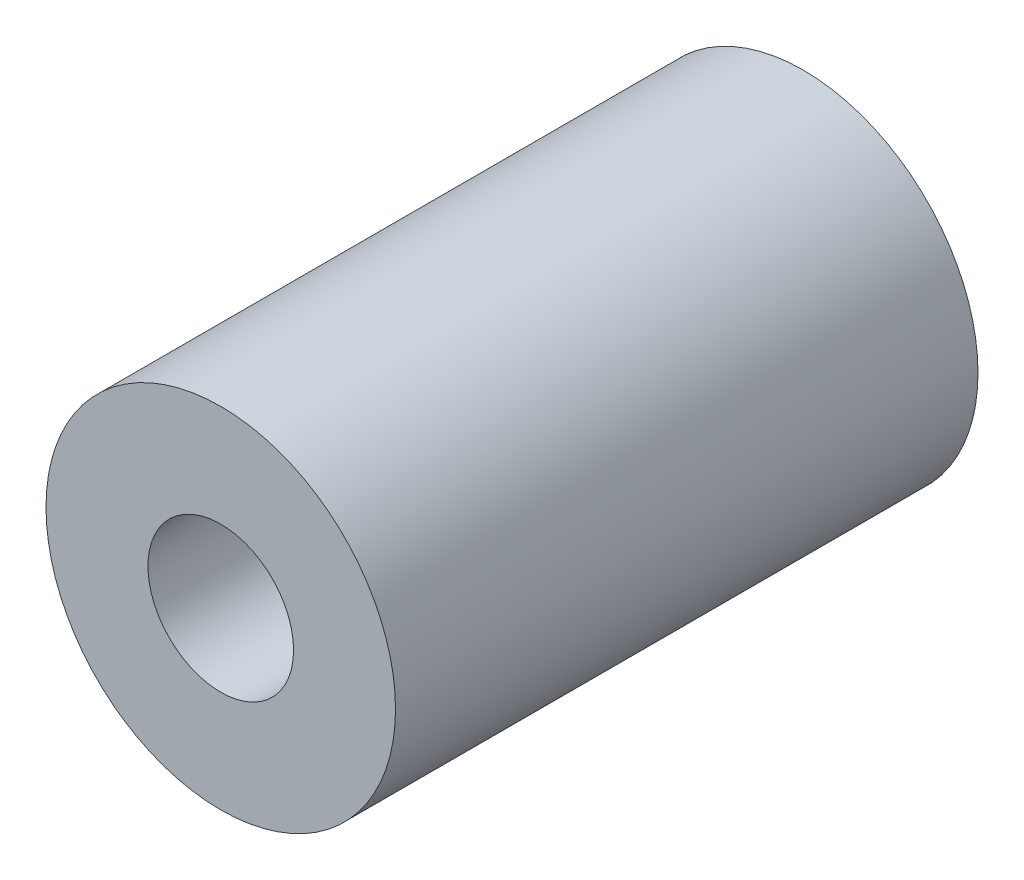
ISO-10303-21;
HEADER;
FILE_DESCRIPTION(('STEP AP214'),'2;1');
FILE_NAME('part.step','',(''),(''),'','','');
FILE_SCHEMA(('AUTOMOTIVE_DESIGN { 1 0 10303 214 1 1 1 1 }'));
ENDSEC;
DATA;
#1=APPLICATION_CONTEXT('core data for automotive mechanical design processes');
#2=APPLICATION_PROTOCOL_DEFINITION('international standard','automotive_design',2000,#1);
#3=PRODUCT_CONTEXT('',#1,'mechanical');
#4=PRODUCT('Part','Part','',(#3));
#5=PRODUCT_RELATED_PRODUCT_CATEGORY('part','',(#4));
#6=PRODUCT_DEFINITION_FORMATION('','',#4);
#7=PRODUCT_DEFINITION_CONTEXT('part definition',#1,'design');
#8=PRODUCT_DEFINITION('design','',#6,#7);
#9=PRODUCT_DEFINITION_SHAPE('','',#8);
#10=(LENGTH_UNIT() NAMED_UNIT(*) SI_UNIT(.MILLI.,.METRE.));
#11=(NAMED_UNIT(*) PLANE_ANGLE_UNIT() SI_UNIT($,.RADIAN.));
#12=(NAMED_UNIT(*) SI_UNIT($,.STERADIAN.) SOLID_ANGLE_UNIT());
#13=UNCERTAINTY_MEASURE_WITH_UNIT(LENGTH_MEASURE(1.E-05),#10,'distance_accuracy_value','');
#14=(GEOMETRIC_REPRESENTATION_CONTEXT(3) GLOBAL_UNCERTAINTY_ASSIGNED_CONTEXT((#13)) GLOBAL_UNIT_ASSIGNED_CONTEXT((#10,
#11,#12)) REPRESENTATION_CONTEXT('',''));
#15=CARTESIAN_POINT('',(0.,0.,0.));
#16=DIRECTION('',(0.,0.,1.));
#17=DIRECTION('',(1.,0.,0.));
#18=AXIS2_PLACEMENT_3D('',#15,#16,#17);
#19=CARTESIAN_POINT('',(0.,0.,2.));
#20=DIRECTION('',(0.,0.,1.));
#21=DIRECTION('',(1.,0.,0.));
#22=AXIS2_PLACEMENT_3D('',#19,#20,#21);
#23=PLANE('',#22);
#24=CARTESIAN_POINT('',(0.,0.,2.));
#25=DIRECTION('',(0.,0.,1.));
#26=DIRECTION('',(1.,0.,0.));
#27=AXIS2_PLACEMENT_3D('',#24,#25,#26);
#28=CIRCLE('',#27,1.2);
#29=CARTESIAN_POINT('',(1.2,0.,2.));
#30=VERTEX_POINT('',#29);
#31=EDGE_CURVE('E10',#30,#30,#28,.T.);
#32=ORIENTED_EDGE('',*,*,#31,.T.);
#33=EDGE_LOOP('',(#32));
#34=FACE_BOUND('',#33,.T.);
#35=CARTESIAN_POINT('',(0.,0.,2.));
#36=DIRECTION('',(0.,0.,1.));
#37=DIRECTION('',(1.,0.,0.));
#38=AXIS2_PLACEMENT_3D('',#35,#36,#37);
#39=CIRCLE('',#38,0.5);
#40=CARTESIAN_POINT('',(0.5,0.,2.));
#41=VERTEX_POINT('',#40);
#42=EDGE_CURVE('E42',#41,#41,#39,.T.);
#43=ORIENTED_EDGE('',*,*,#42,.F.);
#44=EDGE_LOOP('',(#43));
#45=FACE_BOUND('',#44,.T.);
#46=ADVANCED_FACE('F31',(#34,#45),#23,.T.);
#47=CARTESIAN_POINT('',(0.,0.,-2.));
#48=DIRECTION('',(0.,0.,1.));
#49=DIRECTION('',(1.,0.,0.));
#50=AXIS2_PLACEMENT_3D('',#47,#48,#49);
#51=PLANE('',#50);
#52=CARTESIAN_POINT('',(0.,0.,-2.));
#53=DIRECTION('',(0.,0.,1.));
#54=DIRECTION('',(1.,0.,0.));
#55=AXIS2_PLACEMENT_3D('',#52,#53,#54);
#56=CIRCLE('',#55,1.2);
#57=CARTESIAN_POINT('',(1.2,0.,-2.));
#58=VERTEX_POINT('',#57);
#59=EDGE_CURVE('E35',#58,#58,#56,.T.);
#60=ORIENTED_EDGE('',*,*,#59,.F.);
#61=EDGE_LOOP('',(#60));
#62=FACE_BOUND('',#61,.T.);
#63=CARTESIAN_POINT('',(0.,0.,-2.));
#64=DIRECTION('',(0.,0.,1.));
#65=DIRECTION('',(1.,0.,0.));
#66=AXIS2_PLACEMENT_3D('',#63,#64,#65);
#67=CIRCLE('',#66,0.5);
#68=CARTESIAN_POINT('',(0.5,0.,-2.));
#69=VERTEX_POINT('',#68);
#70=EDGE_CURVE('E44',#69,#69,#67,.T.);
#71=ORIENTED_EDGE('',*,*,#70,.T.);
#72=EDGE_LOOP('',(#71));
#73=FACE_BOUND('',#72,.T.);
#74=ADVANCED_FACE('F54',(#62,#73),#51,.F.);
#75=CARTESIAN_POINT('',(0.,0.,2.));
#76=DIRECTION('',(0.,0.,-1.));
#77=DIRECTION('',(-1.,0.,0.));
#78=AXIS2_PLACEMENT_3D('',#75,#76,#77);
#79=CYLINDRICAL_SURFACE('',#78,1.2);
#80=ORIENTED_EDGE('',*,*,#31,.F.);
#81=EDGE_LOOP('',(#80));
#82=FACE_BOUND('',#81,.T.);
#83=ORIENTED_EDGE('',*,*,#59,.T.);
#84=EDGE_LOOP('',(#83));
#85=FACE_BOUND('',#84,.T.);
#86=ADVANCED_FACE('F33',(#82,#85),#79,.T.);
#87=CARTESIAN_POINT('',(0.,0.,2.));
#88=DIRECTION('',(0.,0.,-1.));
#89=DIRECTION('',(-1.,0.,0.));
#90=AXIS2_PLACEMENT_3D('',#87,#88,#89);
#91=CYLINDRICAL_SURFACE('',#90,0.5);
#92=ORIENTED_EDGE('',*,*,#42,.T.);
#93=EDGE_LOOP('',(#92));
#94=FACE_BOUND('',#93,.T.);
#95=ORIENTED_EDGE('',*,*,#70,.F.);
#96=EDGE_LOOP('',(#95));
#97=FACE_BOUND('',#96,.T.);
#98=ADVANCED_FACE('F50',(#94,#97),#91,.F.);
#99=CLOSED_SHELL('',(#46,#74,#86,#98));
#100=MANIFOLD_SOLID_BREP('B2',#99);
#101=ADVANCED_BREP_SHAPE_REPRESENTATION('',(#18,#100),#14);
#102=SHAPE_DEFINITION_REPRESENTATION(#9,#101);
ENDSEC;
END-ISO-10303-21;
